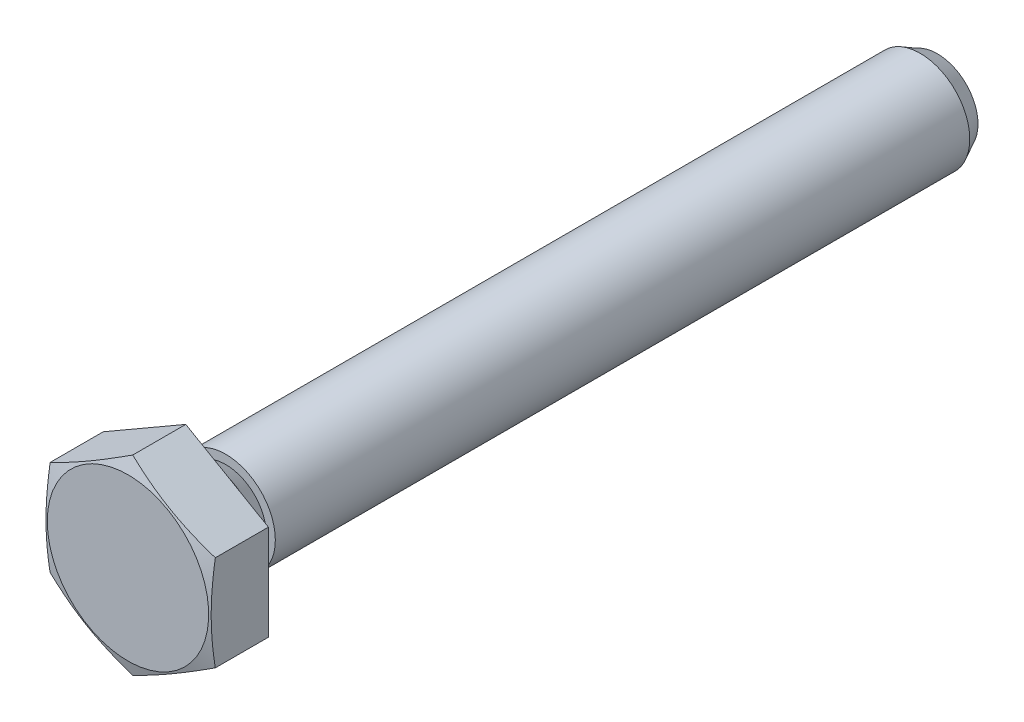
ISO-10303-21;
HEADER;
FILE_DESCRIPTION(('STEP AP214'),'2;1');
FILE_NAME('part.step','',(''),(''),'','','');
FILE_SCHEMA(('AUTOMOTIVE_DESIGN { 1 0 10303 214 1 1 1 1 }'));
ENDSEC;
DATA;
#1=APPLICATION_CONTEXT('core data for automotive mechanical design processes');
#2=APPLICATION_PROTOCOL_DEFINITION('international standard','automotive_design',2000,#1);
#3=PRODUCT_CONTEXT('',#1,'mechanical');
#4=PRODUCT('Part','Part','',(#3));
#5=PRODUCT_RELATED_PRODUCT_CATEGORY('part','',(#4));
#6=PRODUCT_DEFINITION_FORMATION('','',#4);
#7=PRODUCT_DEFINITION_CONTEXT('part definition',#1,'design');
#8=PRODUCT_DEFINITION('design','',#6,#7);
#9=PRODUCT_DEFINITION_SHAPE('','',#8);
#10=(LENGTH_UNIT() NAMED_UNIT(*) SI_UNIT(.MILLI.,.METRE.));
#11=(NAMED_UNIT(*) PLANE_ANGLE_UNIT() SI_UNIT($,.RADIAN.));
#12=(NAMED_UNIT(*) SI_UNIT($,.STERADIAN.) SOLID_ANGLE_UNIT());
#13=UNCERTAINTY_MEASURE_WITH_UNIT(LENGTH_MEASURE(1.E-05),#10,'distance_accuracy_value','');
#14=(GEOMETRIC_REPRESENTATION_CONTEXT(3) GLOBAL_UNCERTAINTY_ASSIGNED_CONTEXT((#13)) GLOBAL_UNIT_ASSIGNED_CONTEXT((#10,
#11,#12)) REPRESENTATION_CONTEXT('',''));
#15=CARTESIAN_POINT('',(0.,0.,0.));
#16=DIRECTION('',(0.,0.,1.));
#17=DIRECTION('',(1.,0.,0.));
#18=AXIS2_PLACEMENT_3D('',#15,#16,#17);
#19=CARTESIAN_POINT('',(0.,0.,0.5));
#20=DIRECTION('',(0.,0.,1.));
#21=DIRECTION('',(1.,0.,0.));
#22=AXIS2_PLACEMENT_3D('',#19,#20,#21);
#23=TOROIDAL_SURFACE('',#22,3.85,0.5);
#24=CARTESIAN_POINT('',(0.,0.,0.5));
#25=DIRECTION('',(0.,0.,1.));
#26=DIRECTION('',(1.,0.,0.));
#27=AXIS2_PLACEMENT_3D('',#24,#25,#26);
#28=CIRCLE('',#27,4.35);
#29=CARTESIAN_POINT('',(4.35000000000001,0.,0.500000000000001));
#30=VERTEX_POINT('',#29);
#31=EDGE_CURVE('E11',#30,#30,#28,.T.);
#32=ORIENTED_EDGE('',*,*,#31,.F.);
#33=EDGE_LOOP('',(#32));
#34=FACE_BOUND('',#33,.T.);
#35=CARTESIAN_POINT('',(0.,0.,0.));
#36=DIRECTION('',(0.,0.,1.));
#37=DIRECTION('',(1.,0.,0.));
#38=AXIS2_PLACEMENT_3D('',#35,#36,#37);
#39=CIRCLE('',#38,3.85);
#40=CARTESIAN_POINT('',(3.85000000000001,0.,0.));
#41=VERTEX_POINT('',#40);
#42=EDGE_CURVE('E24',#41,#41,#39,.T.);
#43=ORIENTED_EDGE('',*,*,#42,.T.);
#44=EDGE_LOOP('',(#43));
#45=FACE_BOUND('',#44,.T.);
#46=ADVANCED_FACE('F17',(#34,#45),#23,.T.);
#47=CARTESIAN_POINT('',(-2.22044604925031E-13,3.84999999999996,0.));
#48=DIRECTION('',(0.,0.,-1.));
#49=DIRECTION('',(-1.,0.,0.));
#50=AXIS2_PLACEMENT_3D('',#47,#48,#49);
#51=PLANE('',#50);
#52=CARTESIAN_POINT('',(0.,0.,0.));
#53=DIRECTION('',(0.,0.,1.));
#54=DIRECTION('',(1.,0.,0.));
#55=AXIS2_PLACEMENT_3D('',#52,#53,#54);
#56=CIRCLE('',#55,3.3);
#57=CARTESIAN_POINT('',(3.3,0.,0.));
#58=VERTEX_POINT('',#57);
#59=EDGE_CURVE('E118',#58,#58,#56,.T.);
#60=ORIENTED_EDGE('',*,*,#59,.T.);
#61=EDGE_LOOP('',(#60));
#62=FACE_BOUND('',#61,.T.);
#63=ORIENTED_EDGE('',*,*,#42,.F.);
#64=EDGE_LOOP('',(#63));
#65=FACE_BOUND('',#64,.T.);
#66=ADVANCED_FACE('F124',(#62,#65),#51,.T.);
#67=CARTESIAN_POINT('',(0.,0.,-0.300000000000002));
#68=DIRECTION('',(0.,0.,1.));
#69=DIRECTION('',(1.,0.,0.));
#70=AXIS2_PLACEMENT_3D('',#67,#68,#69);
#71=TOROIDAL_SURFACE('',#70,3.3,0.3);
#72=CARTESIAN_POINT('',(0.,0.,-0.300000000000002));
#73=DIRECTION('',(0.,0.,1.));
#74=DIRECTION('',(1.,0.,0.));
#75=AXIS2_PLACEMENT_3D('',#72,#73,#74);
#76=CIRCLE('',#75,3.);
#77=CARTESIAN_POINT('',(3.,0.,-0.300000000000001));
#78=VERTEX_POINT('',#77);
#79=EDGE_CURVE('E115',#78,#78,#76,.T.);
#80=ORIENTED_EDGE('',*,*,#79,.T.);
#81=EDGE_LOOP('',(#80));
#82=FACE_BOUND('',#81,.T.);
#83=ORIENTED_EDGE('',*,*,#59,.F.);
#84=EDGE_LOOP('',(#83));
#85=FACE_BOUND('',#84,.T.);
#86=ADVANCED_FACE('F126',(#82,#85),#71,.F.);
#87=CARTESIAN_POINT('',(0.,0.,0.5));
#88=DIRECTION('',(0.,0.,1.));
#89=DIRECTION('',(1.,0.,0.));
#90=AXIS2_PLACEMENT_3D('',#87,#88,#89);
#91=CYLINDRICAL_SURFACE('',#90,3.);
#92=CARTESIAN_POINT('',(0.,0.,-0.982527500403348));
#93=DIRECTION('',(0.,0.,1.));
#94=DIRECTION('',(1.,0.,0.));
#95=AXIS2_PLACEMENT_3D('',#92,#93,#94);
#96=CIRCLE('',#95,3.);
#97=CARTESIAN_POINT('',(3.,0.,-0.982527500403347));
#98=VERTEX_POINT('',#97);
#99=EDGE_CURVE('E112',#98,#98,#96,.T.);
#100=ORIENTED_EDGE('',*,*,#99,.T.);
#101=EDGE_LOOP('',(#100));
#102=FACE_BOUND('',#101,.T.);
#103=ORIENTED_EDGE('',*,*,#79,.F.);
#104=EDGE_LOOP('',(#103));
#105=FACE_BOUND('',#104,.T.);
#106=ADVANCED_FACE('F133',(#102,#105),#91,.T.);
#107=CARTESIAN_POINT('',(0.,0.,-0.982527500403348));
#108=DIRECTION('',(0.,0.,1.));
#109=DIRECTION('',(1.,0.,0.));
#110=AXIS2_PLACEMENT_3D('',#107,#108,#109);
#111=CONICAL_SURFACE('',#110,3.,0.523598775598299);
#112=CARTESIAN_POINT('',(0.,0.,-1.92));
#113=DIRECTION('',(0.,0.,1.));
#114=DIRECTION('',(1.,0.,0.));
#115=AXIS2_PLACEMENT_3D('',#112,#113,#114);
#116=CIRCLE('',#115,2.45875);
#117=CARTESIAN_POINT('',(2.45875,0.,-1.92));
#118=VERTEX_POINT('',#117);
#119=EDGE_CURVE('E109',#118,#118,#116,.T.);
#120=ORIENTED_EDGE('',*,*,#119,.T.);
#121=EDGE_LOOP('',(#120));
#122=FACE_BOUND('',#121,.T.);
#123=ORIENTED_EDGE('',*,*,#99,.F.);
#124=EDGE_LOOP('',(#123));
#125=FACE_BOUND('',#124,.T.);
#126=ADVANCED_FACE('F140',(#122,#125),#111,.T.);
#127=CARTESIAN_POINT('',(0.,2.45874999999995,-1.92));
#128=DIRECTION('',(0.,0.,1.));
#129=DIRECTION('',(1.,0.,0.));
#130=AXIS2_PLACEMENT_3D('',#127,#128,#129);
#131=PLANE('',#130);
#132=CARTESIAN_POINT('',(0.,0.,-1.92));
#133=DIRECTION('',(0.,0.,1.));
#134=DIRECTION('',(1.,0.,0.));
#135=AXIS2_PLACEMENT_3D('',#132,#133,#134);
#136=CIRCLE('',#135,3.);
#137=CARTESIAN_POINT('',(3.,0.,-1.92));
#138=VERTEX_POINT('',#137);
#139=EDGE_CURVE('E106',#138,#138,#136,.T.);
#140=ORIENTED_EDGE('',*,*,#139,.T.);
#141=EDGE_LOOP('',(#140));
#142=FACE_BOUND('',#141,.T.);
#143=ORIENTED_EDGE('',*,*,#119,.F.);
#144=EDGE_LOOP('',(#143));
#145=FACE_BOUND('',#144,.T.);
#146=ADVANCED_FACE('F144',(#142,#145),#131,.T.);
#147=CARTESIAN_POINT('',(0.,0.,0.5));
#148=DIRECTION('',(0.,0.,1.));
#149=DIRECTION('',(1.,0.,0.));
#150=AXIS2_PLACEMENT_3D('',#147,#148,#149);
#151=CYLINDRICAL_SURFACE('',#150,3.);
#152=CARTESIAN_POINT('',(0.,0.,-43.95875));
#153=DIRECTION('',(0.,0.,1.));
#154=DIRECTION('',(1.,0.,0.));
#155=AXIS2_PLACEMENT_3D('',#152,#153,#154);
#156=CIRCLE('',#155,3.);
#157=CARTESIAN_POINT('',(3.,0.,-43.95875));
#158=VERTEX_POINT('',#157);
#159=EDGE_CURVE('E103',#158,#158,#156,.T.);
#160=ORIENTED_EDGE('',*,*,#159,.T.);
#161=EDGE_LOOP('',(#160));
#162=FACE_BOUND('',#161,.T.);
#163=ORIENTED_EDGE('',*,*,#139,.F.);
#164=EDGE_LOOP('',(#163));
#165=FACE_BOUND('',#164,.T.);
#166=ADVANCED_FACE('F148',(#162,#165),#151,.T.);
#167=CARTESIAN_POINT('',(0.,0.,-43.95875));
#168=DIRECTION('',(0.,0.,1.));
#169=DIRECTION('',(1.,0.,0.));
#170=AXIS2_PLACEMENT_3D('',#167,#168,#169);
#171=CONICAL_SURFACE('',#170,3.,0.479368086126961);
#172=CARTESIAN_POINT('',(0.,0.,-45.));
#173=DIRECTION('',(0.,0.,1.));
#174=DIRECTION('',(1.,0.,0.));
#175=AXIS2_PLACEMENT_3D('',#172,#173,#174);
#176=CIRCLE('',#175,2.45875);
#177=CARTESIAN_POINT('',(2.45875,0.,-45.));
#178=VERTEX_POINT('',#177);
#179=EDGE_CURVE('E100',#178,#178,#176,.T.);
#180=ORIENTED_EDGE('',*,*,#179,.T.);
#181=EDGE_LOOP('',(#180));
#182=FACE_BOUND('',#181,.T.);
#183=ORIENTED_EDGE('',*,*,#159,.F.);
#184=EDGE_LOOP('',(#183));
#185=FACE_BOUND('',#184,.T.);
#186=ADVANCED_FACE('F152',(#182,#185),#171,.T.);
#187=CARTESIAN_POINT('',(0.,2.45874999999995,-45.));
#188=DIRECTION('',(0.,0.,-1.));
#189=DIRECTION('',(-1.,0.,0.));
#190=AXIS2_PLACEMENT_3D('',#187,#188,#189);
#191=PLANE('',#190);
#192=ORIENTED_EDGE('',*,*,#179,.F.);
#193=EDGE_LOOP('',(#192));
#194=FACE_BOUND('',#193,.T.);
#195=ADVANCED_FACE('F156',(#194),#191,.T.);
#196=CARTESIAN_POINT('',(-5.00000000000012,-2.88675000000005,0.5));
#197=DIRECTION('',(0.,0.,-1.));
#198=DIRECTION('',(-1.,0.,0.));
#199=AXIS2_PLACEMENT_3D('',#196,#197,#198);
#200=PLANE('',#199);
#201=DIRECTION('',(0.,-1.,0.));
#202=VECTOR('',#201,1.);
#203=CARTESIAN_POINT('',(-5.00000000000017,2.88674999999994,0.5));
#204=LINE('',#203,#202);
#205=CARTESIAN_POINT('',(-5.00000000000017,2.88674999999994,0.5));
#206=VERTEX_POINT('',#205);
#207=CARTESIAN_POINT('',(-5.00000000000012,-2.88675000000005,0.5));
#208=VERTEX_POINT('',#207);
#209=EDGE_CURVE('E83',#206,#208,#204,.T.);
#210=ORIENTED_EDGE('',*,*,#209,.F.);
#211=DIRECTION('',(0.866025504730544,0.499999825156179,0.));
#212=VECTOR('',#211,1.);
#213=CARTESIAN_POINT('',(-5.00000000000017,2.88674999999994,0.5));
#214=LINE('',#213,#212);
#215=CARTESIAN_POINT('',(0.,5.77349999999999,0.5));
#216=VERTEX_POINT('',#215);
#217=EDGE_CURVE('E88',#206,#216,#214,.T.);
#218=ORIENTED_EDGE('',*,*,#217,.T.);
#219=DIRECTION('',(0.866025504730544,-0.49999982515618,0.));
#220=VECTOR('',#219,1.);
#221=CARTESIAN_POINT('',(0.,5.77349999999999,0.5));
#222=LINE('',#221,#220);
#223=CARTESIAN_POINT('',(4.99999999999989,2.88674999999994,0.5));
#224=VERTEX_POINT('',#223);
#225=EDGE_CURVE('E94',#216,#224,#222,.T.);
#226=ORIENTED_EDGE('',*,*,#225,.T.);
#227=DIRECTION('',(0.,-1.,0.));
#228=VECTOR('',#227,1.);
#229=CARTESIAN_POINT('',(4.99999999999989,2.88674999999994,0.5));
#230=LINE('',#229,#228);
#231=CARTESIAN_POINT('',(4.99999999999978,-2.88675000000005,0.5));
#232=VERTEX_POINT('',#231);
#233=EDGE_CURVE('E246',#224,#232,#230,.T.);
#234=ORIENTED_EDGE('',*,*,#233,.T.);
#235=DIRECTION('',(-0.866025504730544,-0.499999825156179,0.));
#236=VECTOR('',#235,1.);
#237=CARTESIAN_POINT('',(4.99999999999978,-2.88675000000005,0.5));
#238=LINE('',#237,#236);
#239=CARTESIAN_POINT('',(0.,-5.77349999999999,0.5));
#240=VERTEX_POINT('',#239);
#241=EDGE_CURVE('E232',#232,#240,#238,.T.);
#242=ORIENTED_EDGE('',*,*,#241,.T.);
#243=DIRECTION('',(-0.866025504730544,0.49999982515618,0.));
#244=VECTOR('',#243,1.);
#245=CARTESIAN_POINT('',(0.,-5.77349999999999,0.5));
#246=LINE('',#245,#244);
#247=EDGE_CURVE('E230',#240,#208,#246,.T.);
#248=ORIENTED_EDGE('',*,*,#247,.T.);
#249=EDGE_LOOP('',(#210,#218,#226,#234,#242,#248));
#250=FACE_BOUND('',#249,.T.);
#251=ORIENTED_EDGE('',*,*,#31,.T.);
#252=EDGE_LOOP('',(#251));
#253=FACE_BOUND('',#252,.T.);
#254=ADVANCED_FACE('F160',(#250,#253),#200,.T.);
#255=CARTESIAN_POINT('',(-5.00000000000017,2.88674999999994,0.5));
#256=DIRECTION('',(-1.,0.,0.));
#257=DIRECTION('',(0.,0.,1.));
#258=AXIS2_PLACEMENT_3D('',#255,#256,#257);
#259=PLANE('',#258);
#260=CARTESIAN_POINT('',(-5.00000000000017,3.41675832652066,3.62147932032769));
#261=CARTESIAN_POINT('',(-5.00000000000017,3.18521449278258,3.66374586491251));
#262=CARTESIAN_POINT('',(-5.00000000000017,2.95311617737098,3.70321492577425));
#263=CARTESIAN_POINT('',(-5.00000000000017,2.48772048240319,3.77520976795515));
#264=CARTESIAN_POINT('',(-5.00000000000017,2.25442251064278,3.80773169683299));
#265=CARTESIAN_POINT('',(-5.00000000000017,1.78700251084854,3.86440884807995));
#266=CARTESIAN_POINT('',(-5.00000000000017,1.55288140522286,3.88857151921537));
#267=CARTESIAN_POINT('',(-5.00000000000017,1.08387721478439,3.92726925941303));
#268=CARTESIAN_POINT('',(-5.00000000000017,0.848994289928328,3.94180623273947));
#269=CARTESIAN_POINT('',(-5.00000000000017,0.38213901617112,3.96021768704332));
#270=CARTESIAN_POINT('',(-5.00000000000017,0.15017263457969,3.96424046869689));
#271=CARTESIAN_POINT('',(-5.00000000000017,-0.313714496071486,3.96178586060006));
#272=CARTESIAN_POINT('',(-5.00000000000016,-0.545635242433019,3.95530797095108));
#273=CARTESIAN_POINT('',(-5.00000000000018,-1.00889633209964,3.93227848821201));
#274=CARTESIAN_POINT('',(-5.00000000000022,-1.24023682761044,3.91572989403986));
#275=CARTESIAN_POINT('',(-5.00000000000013,-1.70207710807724,3.87354149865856));
#276=CARTESIAN_POINT('',(-5.,-1.93257687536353,3.84790150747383));
#277=CARTESIAN_POINT('',(-5.,-2.39244352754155,3.78882004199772));
#278=CARTESIAN_POINT('',(-5.00000000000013,-2.62181091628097,3.75538243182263));
#279=CARTESIAN_POINT('',(-5.00000000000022,-3.07949423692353,3.68201701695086));
#280=CARTESIAN_POINT('',(-5.00000000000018,-3.30781016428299,3.64208918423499));
#281=CARTESIAN_POINT('',(-5.00000000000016,-3.76361168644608,3.55691732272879));
#282=CARTESIAN_POINT('',(-5.00000000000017,-3.99109655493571,3.51166944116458));
#283=CARTESIAN_POINT('',(-5.00000000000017,-4.44517705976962,3.41690513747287));
#284=CARTESIAN_POINT('',(-5.00000000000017,-4.67177266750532,3.36738857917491));
#285=CARTESIAN_POINT('',(-5.00000000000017,-5.12792425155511,3.26407751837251));
#286=CARTESIAN_POINT('',(-5.00000000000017,-5.35746720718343,3.21022580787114));
#287=CARTESIAN_POINT('',(-5.00000000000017,-5.81586669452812,3.0996738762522));
#288=CARTESIAN_POINT('',(-5.00000000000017,-6.0447232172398,3.0429736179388));
#289=CARTESIAN_POINT('',(-5.00000000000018,-6.50137473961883,2.92739984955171));
#290=CARTESIAN_POINT('',(-5.00000000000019,-6.72917095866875,2.86853114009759));
#291=CARTESIAN_POINT('',(-5.00000000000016,-7.18425622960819,2.74892017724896));
#292=CARTESIAN_POINT('',(-5.00000000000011,-7.41154531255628,2.68817804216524));
#293=CARTESIAN_POINT('',(-5.,-7.63863176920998,2.62670107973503));
#294=B_SPLINE_CURVE_WITH_KNOTS('',3,(#260,#261,#262,#263,#264,#265,#266,#267,#268,#269,#270,
#271,#272,#273,#274,#275,#276,#277,#278,#279,#280,#281,#282,#283,#284,#285,#286,#287,#288,#289,
#290,#291,#292,#293),.UNSPECIFIED.,.F.,.F.,(4,2,2,2,2,2,2,2,2,2,2,2,2,2,2,2,4),(0.,
0.706157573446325,1.41270572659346,2.11862265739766,2.8243998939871,3.52016717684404,
4.21596758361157,4.91156089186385,5.60716873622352,6.30243260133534,6.99769946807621,
7.69347298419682,8.38926870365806,9.09657212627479,9.80388478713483,10.5097159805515,
11.215502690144),.UNSPECIFIED.);
#295=CARTESIAN_POINT('',(-5.00000000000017,2.88674999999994,3.71288574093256));
#296=VERTEX_POINT('',#295);
#297=CARTESIAN_POINT('',(-5.00000000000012,-2.88675000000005,3.71288574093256));
#298=VERTEX_POINT('',#297);
#299=EDGE_CURVE('E72',#296,#298,#294,.T.);
#300=ORIENTED_EDGE('',*,*,#299,.F.);
#301=DIRECTION('',(0.,0.,1.));
#302=VECTOR('',#301,1.);
#303=CARTESIAN_POINT('',(-5.00000000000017,2.88674999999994,0.5));
#304=LINE('',#303,#302);
#305=EDGE_CURVE('E81',#206,#296,#304,.T.);
#306=ORIENTED_EDGE('',*,*,#305,.F.);
#307=ORIENTED_EDGE('',*,*,#209,.T.);
#308=DIRECTION('',(0.,0.,1.));
#309=VECTOR('',#308,1.);
#310=CARTESIAN_POINT('',(-5.00000000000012,-2.88675000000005,0.5));
#311=LINE('',#310,#309);
#312=EDGE_CURVE('E39',#208,#298,#311,.T.);
#313=ORIENTED_EDGE('',*,*,#312,.T.);
#314=EDGE_LOOP('',(#300,#306,#307,#313));
#315=FACE_BOUND('',#314,.T.);
#316=ADVANCED_FACE('F79',(#315),#259,.T.);
#317=CARTESIAN_POINT('',(0.,-5.77349999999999,0.5));
#318=DIRECTION('',(0.49999982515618,0.866025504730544,0.));
#319=DIRECTION('',(0.866025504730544,-0.49999982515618,0.));
#320=AXIS2_PLACEMENT_3D('',#317,#318,#319);
#321=PLANE('',#320);
#322=DIRECTION('',(0.,0.,1.));
#323=VECTOR('',#322,1.);
#324=CARTESIAN_POINT('',(0.,-5.77349999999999,0.5));
#325=LINE('',#324,#323);
#326=CARTESIAN_POINT('',(0.,-5.77349999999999,3.71288639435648));
#327=VERTEX_POINT('',#326);
#328=EDGE_CURVE('E237',#240,#327,#325,.T.);
#329=ORIENTED_EDGE('',*,*,#328,.T.);
#330=CARTESIAN_POINT('',(2.00000016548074E-07,-5.77350011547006,3.71288635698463));
#331=CARTESIAN_POINT('',(-0.207322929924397,-5.65380210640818,3.75164026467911));
#332=CARTESIAN_POINT('',(-0.41519017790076,-5.53378995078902,3.78686112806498));
#333=CARTESIAN_POINT('',(-0.831994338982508,-5.29314806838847,3.84878739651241));
#334=CARTESIAN_POINT('',(-1.04093182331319,-5.17251801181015,3.87548763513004));
#335=CARTESIAN_POINT('',(-1.45803647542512,-4.93170264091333,3.91871011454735));
#336=CARTESIAN_POINT('',(-1.66619766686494,-4.81152077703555,3.93530719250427));
#337=CARTESIAN_POINT('',(-2.08290600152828,-4.57093422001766,3.95756562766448));
#338=CARTESIAN_POINT('',(-2.29145301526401,-4.45052960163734,3.9632301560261));
#339=CARTESIAN_POINT('',(-2.70854704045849,-4.20972036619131,3.96323009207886));
#340=CARTESIAN_POINT('',(-2.91709405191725,-4.0893157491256,3.95756549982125));
#341=CARTESIAN_POINT('',(-3.33380237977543,-3.84872919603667,3.93530694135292));
#342=CARTESIAN_POINT('',(-3.54196356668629,-3.72854733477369,3.91870980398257));
#343=CARTESIAN_POINT('',(-3.95906820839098,-3.48773196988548,3.87548721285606));
#344=CARTESIAN_POINT('',(-4.16800568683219,-3.36710191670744,3.8487869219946));
#345=CARTESIAN_POINT('',(-4.58480983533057,-3.12646004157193,3.78686055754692));
#346=CARTESIAN_POINT('',(-4.79267707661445,-3.0064478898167,3.75163965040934));
#347=CARTESIAN_POINT('',(-5.00000020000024,-2.88674988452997,3.71288570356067));
#348=B_SPLINE_CURVE_WITH_KNOTS('',3,(#330,#331,#332,#333,#334,#335,#336,#337,#338,#339,#340,
#341,#342,#343,#344,#345,#346,#347),.UNSPECIFIED.,.F.,.F.,(4,2,2,2,2,2,2,2,4),(0.,
0.72759543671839,1.45563121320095,2.17820641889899,2.90057199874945,3.62293757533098,
4.34551277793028,5.0735485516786,5.80114398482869),.UNSPECIFIED.);
#349=EDGE_CURVE('E84',#327,#298,#348,.T.);
#350=ORIENTED_EDGE('',*,*,#349,.T.);
#351=ORIENTED_EDGE('',*,*,#312,.F.);
#352=ORIENTED_EDGE('',*,*,#247,.F.);
#353=EDGE_LOOP('',(#329,#350,#351,#352));
#354=FACE_BOUND('',#353,.T.);
#355=ADVANCED_FACE('F165',(#354),#321,.F.);
#356=CARTESIAN_POINT('',(4.99999999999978,-2.88675000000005,0.5));
#357=DIRECTION('',(-0.499999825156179,0.866025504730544,0.));
#358=DIRECTION('',(0.866025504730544,0.499999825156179,0.));
#359=AXIS2_PLACEMENT_3D('',#356,#357,#358);
#360=PLANE('',#359);
#361=DIRECTION('',(0.,0.,1.));
#362=VECTOR('',#361,1.);
#363=CARTESIAN_POINT('',(4.99999999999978,-2.88675000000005,0.5));
#364=LINE('',#363,#362);
#365=CARTESIAN_POINT('',(4.99999999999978,-2.88675000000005,3.71288574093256));
#366=VERTEX_POINT('',#365);
#367=EDGE_CURVE('E240',#232,#366,#364,.T.);
#368=ORIENTED_EDGE('',*,*,#367,.T.);
#369=CARTESIAN_POINT('',(5.00000019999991,-2.88674988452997,3.71288570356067));
#370=CARTESIAN_POINT('',(4.79267707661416,-3.00644788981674,3.75163965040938));
#371=CARTESIAN_POINT('',(4.58480983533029,-3.12646004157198,3.78686055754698));
#372=CARTESIAN_POINT('',(4.16800568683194,-3.36710191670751,3.84878692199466));
#373=CARTESIAN_POINT('',(3.95906820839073,-3.48773196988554,3.87548721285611));
#374=CARTESIAN_POINT('',(3.54196356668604,-3.72854733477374,3.91870980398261));
#375=CARTESIAN_POINT('',(3.33380237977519,-3.84872919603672,3.93530694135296));
#376=CARTESIAN_POINT('',(2.91709405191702,-4.08931574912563,3.95756549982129));
#377=CARTESIAN_POINT('',(2.70854704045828,-4.20972036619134,3.96323009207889));
#378=CARTESIAN_POINT('',(2.29145301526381,-4.45052960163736,3.96323015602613));
#379=CARTESIAN_POINT('',(2.08290600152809,-4.57093422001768,3.9575656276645));
#380=CARTESIAN_POINT('',(1.66619766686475,-4.81152077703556,3.93530719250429));
#381=CARTESIAN_POINT('',(1.45803647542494,-4.93170264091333,3.91871011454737));
#382=CARTESIAN_POINT('',(1.04093182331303,-5.17251801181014,3.87548763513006));
#383=CARTESIAN_POINT('',(0.831994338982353,-5.29314806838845,3.84878739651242));
#384=CARTESIAN_POINT('',(0.415190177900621,-5.53378995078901,3.78686112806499));
#385=CARTESIAN_POINT('',(0.207322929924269,-5.65380210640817,3.75164026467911));
#386=CARTESIAN_POINT('',(-2.00000127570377E-07,-5.77350011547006,3.71288635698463));
#387=B_SPLINE_CURVE_WITH_KNOTS('',3,(#369,#370,#371,#372,#373,#374,#375,#376,#377,#378,#379,
#380,#381,#382,#383,#384,#385,#386),.UNSPECIFIED.,.F.,.F.,(4,2,2,2,2,2,2,2,4),(0.,
0.727595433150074,1.45563120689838,2.17820640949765,2.90057198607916,3.6229375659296,
4.34551277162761,5.07354854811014,5.80114398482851),.UNSPECIFIED.);
#388=EDGE_CURVE('E203',#366,#327,#387,.T.);
#389=ORIENTED_EDGE('',*,*,#388,.T.);
#390=ORIENTED_EDGE('',*,*,#328,.F.);
#391=ORIENTED_EDGE('',*,*,#241,.F.);
#392=EDGE_LOOP('',(#368,#389,#390,#391));
#393=FACE_BOUND('',#392,.T.);
#394=ADVANCED_FACE('F208',(#393),#360,.F.);
#395=CARTESIAN_POINT('',(4.99999999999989,2.88674999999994,0.5));
#396=DIRECTION('',(-1.,0.,0.));
#397=DIRECTION('',(0.,0.,1.));
#398=AXIS2_PLACEMENT_3D('',#395,#396,#397);
#399=PLANE('',#398);
#400=DIRECTION('',(0.,0.,1.));
#401=VECTOR('',#400,1.);
#402=CARTESIAN_POINT('',(4.99999999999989,2.88674999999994,0.5));
#403=LINE('',#402,#401);
#404=CARTESIAN_POINT('',(4.99999999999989,2.88674999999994,3.71288574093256));
#405=VERTEX_POINT('',#404);
#406=EDGE_CURVE('E92',#224,#405,#403,.T.);
#407=ORIENTED_EDGE('',*,*,#406,.T.);
#408=CARTESIAN_POINT('',(4.99999999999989,3.41675832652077,3.6214793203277));
#409=CARTESIAN_POINT('',(4.99999999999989,3.18521449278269,3.66374586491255));
#410=CARTESIAN_POINT('',(4.99999999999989,2.95311617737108,3.7032149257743));
#411=CARTESIAN_POINT('',(4.99999999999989,2.48772048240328,3.77520976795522));
#412=CARTESIAN_POINT('',(4.99999999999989,2.25442251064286,3.80773169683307));
#413=CARTESIAN_POINT('',(4.99999999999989,1.78700251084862,3.86440884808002));
#414=CARTESIAN_POINT('',(4.99999999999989,1.55288140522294,3.88857151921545));
#415=CARTESIAN_POINT('',(4.99999999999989,1.08387721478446,3.92726925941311));
#416=CARTESIAN_POINT('',(4.99999999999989,0.848994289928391,3.94180623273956));
#417=CARTESIAN_POINT('',(4.99999999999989,0.382139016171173,3.96021768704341));
#418=CARTESIAN_POINT('',(4.99999999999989,0.150172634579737,3.96424046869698));
#419=CARTESIAN_POINT('',(4.99999999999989,-0.313714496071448,3.96178586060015));
#420=CARTESIAN_POINT('',(4.99999999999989,-0.545635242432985,3.95530797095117));
#421=CARTESIAN_POINT('',(4.99999999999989,-1.00889633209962,3.9322784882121));
#422=CARTESIAN_POINT('',(4.99999999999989,-1.24023682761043,3.91572989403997));
#423=CARTESIAN_POINT('',(4.99999999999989,-1.70207710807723,3.87354149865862));
#424=CARTESIAN_POINT('',(4.99999999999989,-1.93257687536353,3.84790150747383));
#425=CARTESIAN_POINT('',(4.99999999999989,-2.39244352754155,3.78882004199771));
#426=CARTESIAN_POINT('',(4.99999999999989,-2.62181091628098,3.75538243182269));
#427=CARTESIAN_POINT('',(4.99999999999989,-3.07949423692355,3.68201701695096));
#428=CARTESIAN_POINT('',(4.99999999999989,-3.30781016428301,3.64208918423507));
#429=CARTESIAN_POINT('',(4.99999999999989,-3.7636116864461,3.55691732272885));
#430=CARTESIAN_POINT('',(4.99999999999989,-3.99109655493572,3.51166944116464));
#431=CARTESIAN_POINT('',(4.99999999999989,-4.44517705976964,3.41690513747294));
#432=CARTESIAN_POINT('',(4.99999999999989,-4.67177266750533,3.36738857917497));
#433=CARTESIAN_POINT('',(4.99999999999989,-5.12792425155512,3.26407751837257));
#434=CARTESIAN_POINT('',(4.99999999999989,-5.35746720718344,3.2102258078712));
#435=CARTESIAN_POINT('',(4.99999999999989,-5.81586669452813,3.09967387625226));
#436=CARTESIAN_POINT('',(4.99999999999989,-6.04472321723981,3.04297361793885));
#437=CARTESIAN_POINT('',(4.99999999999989,-6.50137473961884,2.92739984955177));
#438=CARTESIAN_POINT('',(4.99999999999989,-6.72917095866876,2.86853114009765));
#439=CARTESIAN_POINT('',(4.99999999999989,-7.1842562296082,2.74892017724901));
#440=CARTESIAN_POINT('',(4.99999999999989,-7.41154531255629,2.68817804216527));
#441=CARTESIAN_POINT('',(4.99999999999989,-7.63863176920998,2.62670107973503));
#442=B_SPLINE_CURVE_WITH_KNOTS('',3,(#408,#409,#410,#411,#412,#413,#414,#415,#416,#417,#418,
#419,#420,#421,#422,#423,#424,#425,#426,#427,#428,#429,#430,#431,#432,#433,#434,#435,#436,#437,
#438,#439,#440,#441),.UNSPECIFIED.,.F.,.F.,(4,2,2,2,2,2,2,2,2,2,2,2,2,2,2,2,4),(0.,
0.706157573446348,1.4127057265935,2.11862265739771,2.82439989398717,3.52016717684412,
4.21596758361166,4.91156089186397,5.60716873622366,6.30243260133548,6.99769946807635,
7.69347298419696,8.38926870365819,9.09657212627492,9.80388478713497,10.5097159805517,
11.2155026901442),.UNSPECIFIED.);
#443=EDGE_CURVE('E198',#405,#366,#442,.T.);
#444=ORIENTED_EDGE('',*,*,#443,.T.);
#445=ORIENTED_EDGE('',*,*,#367,.F.);
#446=ORIENTED_EDGE('',*,*,#233,.F.);
#447=EDGE_LOOP('',(#407,#444,#445,#446));
#448=FACE_BOUND('',#447,.T.);
#449=ADVANCED_FACE('F211',(#448),#399,.F.);
#450=CARTESIAN_POINT('',(0.,5.77349999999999,0.5));
#451=DIRECTION('',(-0.49999982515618,-0.866025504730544,0.));
#452=DIRECTION('',(-0.866025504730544,0.49999982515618,0.));
#453=AXIS2_PLACEMENT_3D('',#450,#451,#452);
#454=PLANE('',#453);
#455=DIRECTION('',(0.,0.,1.));
#456=VECTOR('',#455,1.);
#457=CARTESIAN_POINT('',(0.,5.77349999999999,0.5));
#458=LINE('',#457,#456);
#459=CARTESIAN_POINT('',(0.,5.77349999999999,3.71288639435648));
#460=VERTEX_POINT('',#459);
#461=EDGE_CURVE('E90',#216,#460,#458,.T.);
#462=ORIENTED_EDGE('',*,*,#461,.T.);
#463=CARTESIAN_POINT('',(-2.00000016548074E-07,5.77350011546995,3.71288635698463));
#464=CARTESIAN_POINT('',(0.207322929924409,5.65380210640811,3.75164026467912));
#465=CARTESIAN_POINT('',(0.415190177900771,5.53378995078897,3.78686112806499));
#466=CARTESIAN_POINT('',(0.831994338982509,5.29314806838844,3.84878739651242));
#467=CARTESIAN_POINT('',(1.04093182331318,5.17251801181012,3.87548763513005));
#468=CARTESIAN_POINT('',(1.45803647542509,4.93170264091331,3.91871011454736));
#469=CARTESIAN_POINT('',(1.6661976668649,4.81152077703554,3.93530719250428));
#470=CARTESIAN_POINT('',(2.08290600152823,4.57093422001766,3.95756562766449));
#471=CARTESIAN_POINT('',(2.29145301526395,4.45052960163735,3.96323015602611));
#472=CARTESIAN_POINT('',(2.70854704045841,4.20972036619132,3.96323009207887));
#473=CARTESIAN_POINT('',(2.91709405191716,4.08931574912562,3.95756549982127));
#474=CARTESIAN_POINT('',(3.33380237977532,3.84872919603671,3.93530694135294));
#475=CARTESIAN_POINT('',(3.54196356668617,3.72854733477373,3.91870980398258));
#476=CARTESIAN_POINT('',(3.95906820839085,3.48773196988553,3.87548721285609));
#477=CARTESIAN_POINT('',(4.16800568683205,3.3671019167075,3.84878692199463));
#478=CARTESIAN_POINT('',(4.5848098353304,3.12646004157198,3.78686055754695));
#479=CARTESIAN_POINT('',(4.79267707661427,3.00644788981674,3.75163965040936));
#480=CARTESIAN_POINT('',(5.00000020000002,2.88674988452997,3.71288570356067));
#481=B_SPLINE_CURVE_WITH_KNOTS('',3,(#463,#464,#465,#466,#467,#468,#469,#470,#471,#472,#473,
#474,#475,#476,#477,#478,#479,#480),.UNSPECIFIED.,.F.,.F.,(4,2,2,2,2,2,2,2,4),(0.,
0.72759543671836,1.45563121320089,2.1782064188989,2.90057199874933,3.62293757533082,
4.34551277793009,5.07354855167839,5.80114398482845),.UNSPECIFIED.);
#482=EDGE_CURVE('E31',#460,#405,#481,.T.);
#483=ORIENTED_EDGE('',*,*,#482,.T.);
#484=ORIENTED_EDGE('',*,*,#406,.F.);
#485=ORIENTED_EDGE('',*,*,#225,.F.);
#486=EDGE_LOOP('',(#462,#483,#484,#485));
#487=FACE_BOUND('',#486,.T.);
#488=ADVANCED_FACE('F215',(#487),#454,.F.);
#489=CARTESIAN_POINT('',(-5.00000000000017,2.88674999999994,0.5));
#490=DIRECTION('',(0.499999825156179,-0.866025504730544,0.));
#491=DIRECTION('',(-0.866025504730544,-0.499999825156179,0.));
#492=AXIS2_PLACEMENT_3D('',#489,#490,#491);
#493=PLANE('',#492);
#494=ORIENTED_EDGE('',*,*,#305,.T.);
#495=CARTESIAN_POINT('',(-5.00000020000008,2.88674988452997,3.71288570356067));
#496=CARTESIAN_POINT('',(-4.79267707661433,3.00644788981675,3.75163965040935));
#497=CARTESIAN_POINT('',(-4.58480983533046,3.12646004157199,3.78686055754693));
#498=CARTESIAN_POINT('',(-4.16800568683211,3.36710191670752,3.84878692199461));
#499=CARTESIAN_POINT('',(-3.9590682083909,3.48773196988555,3.87548721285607));
#500=CARTESIAN_POINT('',(-3.54196356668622,3.72854733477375,3.91870980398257));
#501=CARTESIAN_POINT('',(-3.33380237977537,3.84872919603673,3.93530694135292));
#502=CARTESIAN_POINT('',(-2.9170940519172,4.08931574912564,3.95756549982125));
#503=CARTESIAN_POINT('',(-2.70854704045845,4.20972036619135,3.96323009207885));
#504=CARTESIAN_POINT('',(-2.29145301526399,4.45052960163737,3.9632301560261));
#505=CARTESIAN_POINT('',(-2.08290600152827,4.57093422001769,3.95756562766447));
#506=CARTESIAN_POINT('',(-1.66619766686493,4.81152077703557,3.93530719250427));
#507=CARTESIAN_POINT('',(-1.45803647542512,4.93170264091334,3.91871011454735));
#508=CARTESIAN_POINT('',(-1.04093182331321,5.17251801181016,3.87548763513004));
#509=CARTESIAN_POINT('',(-0.83199433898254,5.29314806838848,3.84878739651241));
#510=CARTESIAN_POINT('',(-0.415190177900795,5.533789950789,3.78686112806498));
#511=CARTESIAN_POINT('',(-0.207322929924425,5.65380210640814,3.75164026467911));
#512=CARTESIAN_POINT('',(2.00000016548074E-07,5.77350011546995,3.71288635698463));
#513=B_SPLINE_CURVE_WITH_KNOTS('',3,(#495,#496,#497,#498,#499,#500,#501,#502,#503,#504,#505,
#506,#507,#508,#509,#510,#511,#512),.UNSPECIFIED.,.F.,.F.,(4,2,2,2,2,2,2,2,4),(0.,
0.727595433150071,1.45563120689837,2.17820640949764,2.90057198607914,3.62293756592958,
4.3455127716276,5.07354854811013,5.8011439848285),.UNSPECIFIED.);
#514=EDGE_CURVE('E68',#296,#460,#513,.T.);
#515=ORIENTED_EDGE('',*,*,#514,.T.);
#516=ORIENTED_EDGE('',*,*,#461,.F.);
#517=ORIENTED_EDGE('',*,*,#217,.F.);
#518=EDGE_LOOP('',(#494,#515,#516,#517));
#519=FACE_BOUND('',#518,.T.);
#520=ADVANCED_FACE('F86',(#519),#493,.F.);
#521=CARTESIAN_POINT('',(0.,0.,3.67551454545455));
#522=DIRECTION('',(0.,0.,-1.));
#523=DIRECTION('',(-1.,0.,0.));
#524=AXIS2_PLACEMENT_3D('',#521,#522,#523);
#525=CONICAL_SURFACE('',#524,5.88897,1.25778607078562);
#526=ORIENTED_EDGE('',*,*,#299,.T.);
#527=ORIENTED_EDGE('',*,*,#349,.F.);
#528=ORIENTED_EDGE('',*,*,#388,.F.);
#529=ORIENTED_EDGE('',*,*,#443,.F.);
#530=ORIENTED_EDGE('',*,*,#482,.F.);
#531=ORIENTED_EDGE('',*,*,#514,.F.);
#532=EDGE_LOOP('',(#526,#527,#528,#529,#530,#531));
#533=FACE_BOUND('',#532,.T.);
#534=CARTESIAN_POINT('',(0.,0.,4.));
#535=DIRECTION('',(0.,0.,-1.));
#536=DIRECTION('',(-1.,0.,0.));
#537=AXIS2_PLACEMENT_3D('',#534,#535,#536);
#538=CIRCLE('',#537,4.88638820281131);
#539=CARTESIAN_POINT('',(-4.88638820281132,0.,4.));
#540=VERTEX_POINT('',#539);
#541=EDGE_CURVE('E76',#540,#540,#538,.F.);
#542=ORIENTED_EDGE('',*,*,#541,.F.);
#543=EDGE_LOOP('',(#542));
#544=FACE_BOUND('',#543,.T.);
#545=ADVANCED_FACE('F70',(#533,#544),#525,.T.);
#546=CARTESIAN_POINT('',(-5.00000000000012,-2.88675000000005,4.));
#547=DIRECTION('',(0.,0.,-1.));
#548=DIRECTION('',(-1.,0.,0.));
#549=AXIS2_PLACEMENT_3D('',#546,#547,#548);
#550=PLANE('',#549);
#551=ORIENTED_EDGE('',*,*,#541,.T.);
#552=EDGE_LOOP('',(#551));
#553=FACE_BOUND('',#552,.T.);
#554=ADVANCED_FACE('F181',(#553),#550,.F.);
#555=CLOSED_SHELL('',(#46,#66,#86,#106,#126,#146,#166,#186,#195,#254,#316,#355,#394,#449,#488,
#520,#545,#554));
#556=MANIFOLD_SOLID_BREP('B1',#555);
#557=ADVANCED_BREP_SHAPE_REPRESENTATION('',(#18,#556),#14);
#558=SHAPE_DEFINITION_REPRESENTATION(#9,#557);
ENDSEC;
END-ISO-10303-21;
